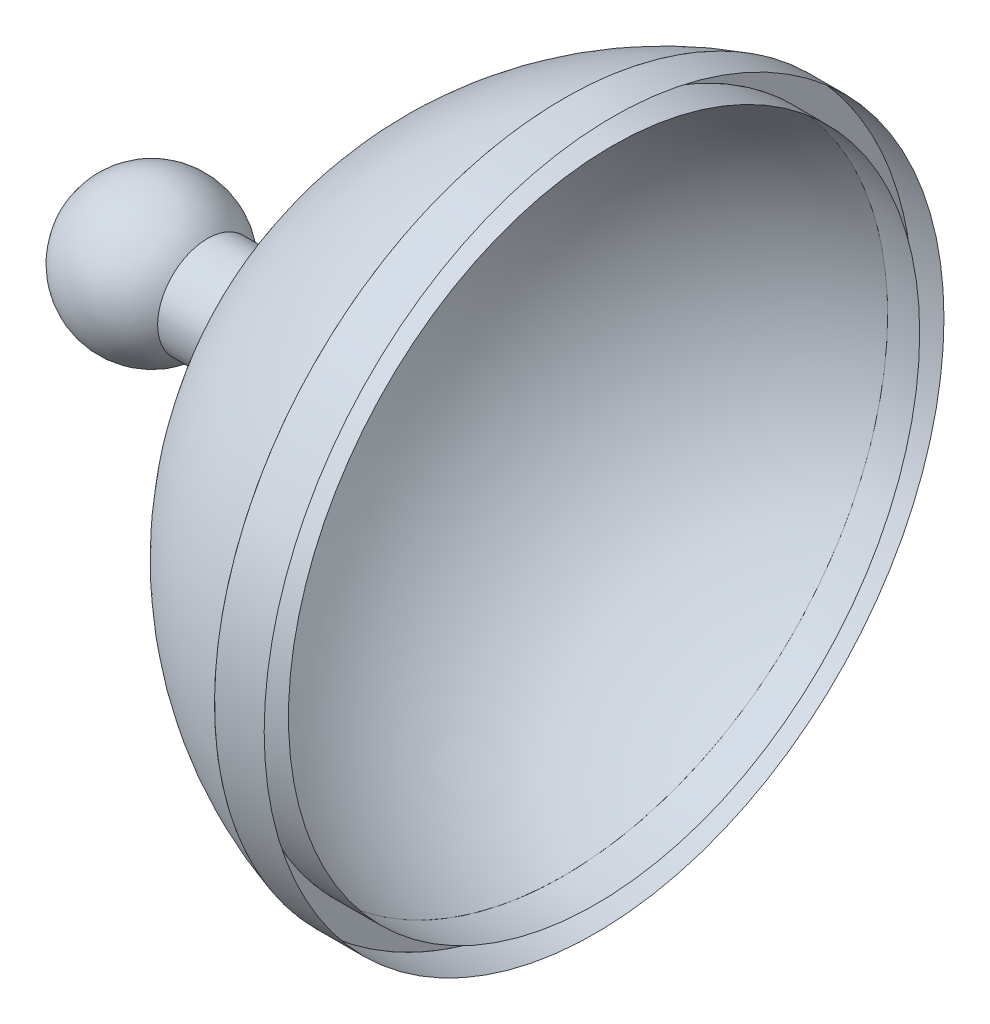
from build123d import *


with BuildPart() as part:
    # Esquisse1 → R_volution2 (revolve)
    with BuildSketch(Plane.XY):
        with BuildLine():
            Line((0.284931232, 0.5), (1.284931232, 0.5))
            Line((1.284931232, 0.5), (1.284931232, 0))
            Line((1.284931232, 0), (-1.024085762, 0))
            ThreePointArc((-1.024085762, 0), (-0.541702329, 0.700629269), (0.284931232, 0.5))
        make_face()
    revolve(axis=Axis((-0.581094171, 0, 0), (1, 0, 0)))

    # Esquisse2 → R_volution3 (revolve)
    with BuildSketch(Plane.XY):
        with BuildLine():
            Line((3.854868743, 3.5), (3.854868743, 3.25))
            ThreePointArc((3.854868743, 3.25), (2.009622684, 2.069549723), (1.291737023, 0))
            Line((1.291737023, 0), (1.218552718, 0))
            ThreePointArc((1.218552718, 0), (1.951368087, 2.190899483), (3.854868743, 3.5))
        make_face()
    revolve(axis=Axis((-1.698782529, 0, 0), (1, 0, 0)))


solid = part.part
